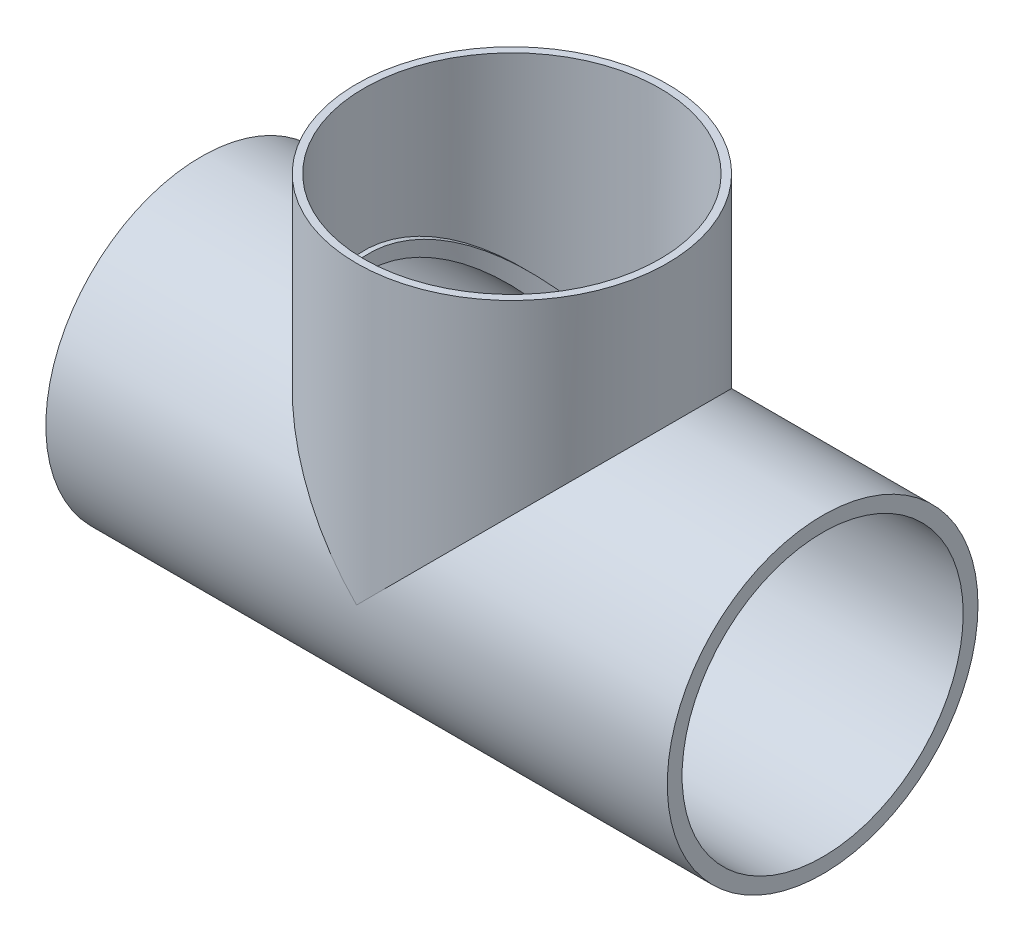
from build123d import *

# Parameters (mm, degrees)
SKETCH1_R                       = 31.5
BOSS_EXTRUDE1_DEPTH             = 126
SHELL1_T                        = -3
BOSS_EXTRUDE4_REACH             = 150.258
BOSS_EXTRUDE4_END_RADIUS        = 31.5
SKETCH2_R                       = 31.5
SKETCH2_R_2                     = 30
BOSS_EXTRUDE4_DIRECTION_2_DEPTH = 20
CUT_EXTRUDE8_DEPTH              = 159.872590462
CUT_EXTRUDE8_DEPTH_BACK         = 42
SKETCH7_R                       = 29


with BuildPart() as part:
    # Sketch1 → Boss-Extrude1 (new body)
    with BuildSketch(Plane(origin=(0, 0, 0), x_dir=(0, 0, -1), z_dir=(1, 0, 0))):
        Circle(SKETCH1_R)
    extrude(amount=BOSS_EXTRUDE1_DEPTH)

    # Shell1
    shell1_openings = [part.faces().sort_by_distance(p)[0] for p in [
        (126, 0, 0),
        (0, 0, 0),
    ]]
    offset(amount=SHELL1_T, openings=shell1_openings, kind=Kind.INTERSECTION)

    # Boss-Extrude4: up to this cylinder (the profile starts outside it)
    boss_extrude4_end = Plane(origin=(63, 0, 0), z_dir=(-1, 0, 0)) * Cylinder(BOSS_EXTRUDE4_END_RADIUS, 364.516, mode=Mode.PRIVATE)
    # Sketch2 → Boss-Extrude4 (add, up to the surface)
    with BuildSketch(Plane(origin=(0, 40, 0), x_dir=(1, 0, 0), z_dir=(0, 1, 0)), mode=Mode.PRIVATE) as boss_extrude4_sk1:
        with Locations(Location((63, 0, 0), (0, 0, 270))):
            Circle(SKETCH2_R)
        with Locations(Location((63, 0, 0), (0, 0, 270))):
            Circle(SKETCH2_R_2, mode=Mode.SUBTRACT)
    boss_extrude4_tool1 = extrude(boss_extrude4_sk1.sketch, amount=-BOSS_EXTRUDE4_REACH, mode=Mode.PRIVATE) - boss_extrude4_end
    add(boss_extrude4_tool1.solids().sort_by_distance((63, 40, -30.609045))[0])

    # Sketch2 → Boss-Extrude4 direction 2 (add)
    with BuildSketch(Plane(origin=(0, 40, 0), x_dir=(1, 0, 0), z_dir=(0, 1, 0))):
        with Locations(Location((63, 0, 0), (0, 0, 270))):
            Circle(SKETCH2_R)
        with Locations(Location((63, 0, 0), (0, 0, 270))):
            Circle(SKETCH2_R_2, mode=Mode.SUBTRACT)
    extrude(amount=BOSS_EXTRUDE4_DIRECTION_2_DEPTH)

    # Sketch7 → Cut-Extrude8 (cut, two sides: drawn at the far end of the back side and taken through both)
    with BuildSketch(Plane(origin=(0, 60, 0), x_dir=(1, 0, 0), z_dir=(0, 1, 0)).offset(-CUT_EXTRUDE8_DEPTH_BACK)):
        with Locations((63, 0)):
            Circle(SKETCH7_R)
    extrude(amount=CUT_EXTRUDE8_DEPTH + CUT_EXTRUDE8_DEPTH_BACK, mode=Mode.SUBTRACT)


solid = part.part
